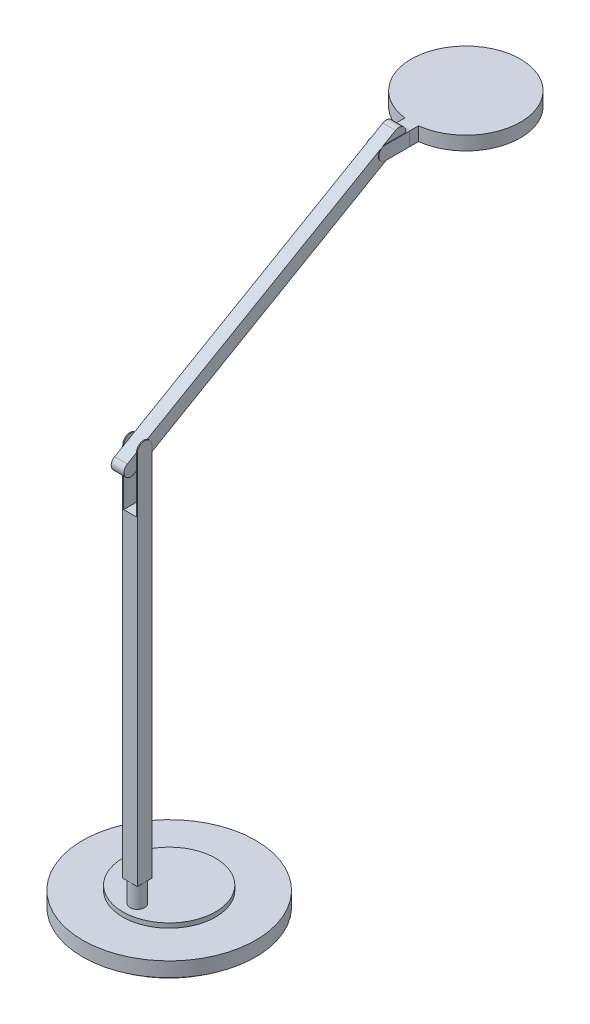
ISO-10303-21;
HEADER;
FILE_DESCRIPTION(('STEP AP214'),'2;1');
FILE_NAME('part.step','',(''),(''),'','','');
FILE_SCHEMA(('AUTOMOTIVE_DESIGN { 1 0 10303 214 1 1 1 1 }'));
ENDSEC;
DATA;
#1=APPLICATION_CONTEXT('core data for automotive mechanical design processes');
#2=APPLICATION_PROTOCOL_DEFINITION('international standard','automotive_design',2000,#1);
#3=PRODUCT_CONTEXT('',#1,'mechanical');
#4=PRODUCT('Part','Part','',(#3));
#5=PRODUCT_RELATED_PRODUCT_CATEGORY('part','',(#4));
#6=PRODUCT_DEFINITION_FORMATION('','',#4);
#7=PRODUCT_DEFINITION_CONTEXT('part definition',#1,'design');
#8=PRODUCT_DEFINITION('design','',#6,#7);
#9=PRODUCT_DEFINITION_SHAPE('','',#8);
#10=(LENGTH_UNIT() NAMED_UNIT(*) SI_UNIT(.MILLI.,.METRE.));
#11=(NAMED_UNIT(*) PLANE_ANGLE_UNIT() SI_UNIT($,.RADIAN.));
#12=(NAMED_UNIT(*) SI_UNIT($,.STERADIAN.) SOLID_ANGLE_UNIT());
#13=UNCERTAINTY_MEASURE_WITH_UNIT(LENGTH_MEASURE(1.E-05),#10,'distance_accuracy_value','');
#14=(GEOMETRIC_REPRESENTATION_CONTEXT(3) GLOBAL_UNCERTAINTY_ASSIGNED_CONTEXT((#13)) GLOBAL_UNIT_ASSIGNED_CONTEXT((#10,
#11,#12)) REPRESENTATION_CONTEXT('',''));
#15=CARTESIAN_POINT('',(0.,0.,0.));
#16=DIRECTION('',(0.,0.,1.));
#17=DIRECTION('',(1.,0.,0.));
#18=AXIS2_PLACEMENT_3D('',#15,#16,#17);
#19=CARTESIAN_POINT('',(-7.5,604.576882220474,-256.636937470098));
#20=DIRECTION('',(0.,-1.,0.));
#21=DIRECTION('',(0.,0.,-1.));
#22=AXIS2_PLACEMENT_3D('',#19,#20,#21);
#23=PLANE('',#22);
#24=CARTESIAN_POINT('',(0.,604.576882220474,-325.745044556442));
#25=DIRECTION('',(0.,-1.,0.));
#26=DIRECTION('',(0.,0.,-1.));
#27=AXIS2_PLACEMENT_3D('',#24,#25,#26);
#28=CIRCLE('',#27,47.9999999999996);
#29=CARTESIAN_POINT('',(0.,604.576882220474,-373.745044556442));
#30=VERTEX_POINT('',#29);
#31=EDGE_CURVE('E150',#30,#30,#28,.T.);
#32=ORIENTED_EDGE('',*,*,#31,.F.);
#33=EDGE_LOOP('',(#32));
#34=FACE_BOUND('',#33,.T.);
#35=DIRECTION('',(0.,0.,1.));
#36=VECTOR('',#35,1.);
#37=CARTESIAN_POINT('',(-7.5,604.576882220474,-266.21564005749));
#38=LINE('',#37,#36);
#39=CARTESIAN_POINT('',(-7.50000000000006,604.576882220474,-266.215640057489));
#40=VERTEX_POINT('',#39);
#41=CARTESIAN_POINT('',(-7.5,604.576882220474,-256.636937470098));
#42=VERTEX_POINT('',#41);
#43=EDGE_CURVE('E81',#40,#42,#38,.T.);
#44=ORIENTED_EDGE('',*,*,#43,.F.);
#45=CARTESIAN_POINT('',(0.,604.576882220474,-325.745044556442));
#46=DIRECTION('',(0.,-1.,0.));
#47=DIRECTION('',(0.,0.,-1.));
#48=AXIS2_PLACEMENT_3D('',#45,#46,#47);
#49=CIRCLE('',#48,60.);
#50=CARTESIAN_POINT('',(7.5,604.576882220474,-266.21564005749));
#51=VERTEX_POINT('',#50);
#52=EDGE_CURVE('E104',#51,#40,#49,.F.);
#53=ORIENTED_EDGE('',*,*,#52,.F.);
#54=DIRECTION('',(0.,0.,-1.));
#55=VECTOR('',#54,1.);
#56=CARTESIAN_POINT('',(7.5,604.576882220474,-256.6369374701));
#57=LINE('',#56,#55);
#58=CARTESIAN_POINT('',(7.5,604.576882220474,-256.636937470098));
#59=VERTEX_POINT('',#58);
#60=EDGE_CURVE('E109',#59,#51,#57,.T.);
#61=ORIENTED_EDGE('',*,*,#60,.F.);
#62=DIRECTION('',(1.,0.,0.));
#63=VECTOR('',#62,1.);
#64=CARTESIAN_POINT('',(-7.5,604.576882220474,-256.636937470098));
#65=LINE('',#64,#63);
#66=EDGE_CURVE('E124',#42,#59,#65,.T.);
#67=ORIENTED_EDGE('',*,*,#66,.F.);
#68=EDGE_LOOP('',(#44,#53,#61,#67));
#69=FACE_BOUND('',#68,.T.);
#70=ADVANCED_FACE('F73',(#34,#69),#23,.T.);
#71=CARTESIAN_POINT('',(0.,619.576882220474,-325.745044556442));
#72=DIRECTION('',(0.,1.,0.));
#73=DIRECTION('',(0.,0.,1.));
#74=AXIS2_PLACEMENT_3D('',#71,#72,#73);
#75=PLANE('',#74);
#76=DIRECTION('',(0.,0.,1.));
#77=VECTOR('',#76,1.);
#78=CARTESIAN_POINT('',(-7.5,619.576882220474,-266.215640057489));
#79=LINE('',#78,#77);
#80=CARTESIAN_POINT('',(-7.50000000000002,619.576882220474,-266.215640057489));
#81=VERTEX_POINT('',#80);
#82=CARTESIAN_POINT('',(-7.5,619.576882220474,-256.636937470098));
#83=VERTEX_POINT('',#82);
#84=EDGE_CURVE('E133',#81,#83,#79,.T.);
#85=ORIENTED_EDGE('',*,*,#84,.T.);
#86=DIRECTION('',(1.,0.,0.));
#87=VECTOR('',#86,1.);
#88=CARTESIAN_POINT('',(-7.5,619.576882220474,-256.636937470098));
#89=LINE('',#88,#87);
#90=CARTESIAN_POINT('',(7.5,619.576882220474,-256.636937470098));
#91=VERTEX_POINT('',#90);
#92=EDGE_CURVE('E122',#83,#91,#89,.T.);
#93=ORIENTED_EDGE('',*,*,#92,.T.);
#94=DIRECTION('',(0.,0.,-1.));
#95=VECTOR('',#94,1.);
#96=CARTESIAN_POINT('',(7.5,619.576882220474,-256.636937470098));
#97=LINE('',#96,#95);
#98=CARTESIAN_POINT('',(7.5,619.576882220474,-266.215640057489));
#99=VERTEX_POINT('',#98);
#100=EDGE_CURVE('E125',#91,#99,#97,.T.);
#101=ORIENTED_EDGE('',*,*,#100,.T.);
#102=CARTESIAN_POINT('',(0.,619.576882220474,-325.745044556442));
#103=DIRECTION('',(0.,1.,0.));
#104=DIRECTION('',(0.,0.,1.));
#105=AXIS2_PLACEMENT_3D('',#102,#103,#104);
#106=CIRCLE('',#105,60.);
#107=EDGE_CURVE('E130',#99,#81,#106,.T.);
#108=ORIENTED_EDGE('',*,*,#107,.T.);
#109=EDGE_LOOP('',(#85,#93,#101,#108));
#110=FACE_BOUND('',#109,.T.);
#111=ADVANCED_FACE('F132',(#110),#75,.T.);
#112=CARTESIAN_POINT('',(-7.5,428.313149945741,-256.636937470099));
#113=DIRECTION('',(0.,0.,1.));
#114=DIRECTION('',(0.,-1.,0.));
#115=AXIS2_PLACEMENT_3D('',#112,#113,#114);
#116=PLANE('',#115);
#117=DIRECTION('',(0.,1.,0.));
#118=VECTOR('',#117,1.);
#119=CARTESIAN_POINT('',(-7.5,428.313149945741,-256.636937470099));
#120=LINE('',#119,#118);
#121=EDGE_CURVE('E13',#42,#83,#120,.T.);
#122=ORIENTED_EDGE('',*,*,#121,.F.);
#123=ORIENTED_EDGE('',*,*,#66,.T.);
#124=DIRECTION('',(0.,1.,0.));
#125=VECTOR('',#124,1.);
#126=CARTESIAN_POINT('',(7.5,428.313149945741,-256.636937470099));
#127=LINE('',#126,#125);
#128=EDGE_CURVE('E119',#59,#91,#127,.T.);
#129=ORIENTED_EDGE('',*,*,#128,.T.);
#130=ORIENTED_EDGE('',*,*,#92,.F.);
#131=EDGE_LOOP('',(#122,#123,#129,#130));
#132=FACE_BOUND('',#131,.T.);
#133=ADVANCED_FACE('F120',(#132),#116,.T.);
#134=CARTESIAN_POINT('',(7.5,428.313149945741,-256.636937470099));
#135=DIRECTION('',(1.,0.,0.));
#136=DIRECTION('',(0.,0.,-1.));
#137=AXIS2_PLACEMENT_3D('',#134,#135,#136);
#138=PLANE('',#137);
#139=ORIENTED_EDGE('',*,*,#128,.F.);
#140=ORIENTED_EDGE('',*,*,#60,.T.);
#141=DIRECTION('',(0.,1.,0.));
#142=VECTOR('',#141,1.);
#143=CARTESIAN_POINT('',(7.5,428.313149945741,-266.21564005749));
#144=LINE('',#143,#142);
#145=EDGE_CURVE('E114',#51,#99,#144,.T.);
#146=ORIENTED_EDGE('',*,*,#145,.T.);
#147=ORIENTED_EDGE('',*,*,#100,.F.);
#148=EDGE_LOOP('',(#139,#140,#146,#147));
#149=FACE_BOUND('',#148,.T.);
#150=ADVANCED_FACE('F126',(#149),#138,.T.);
#151=CARTESIAN_POINT('',(0.,428.313149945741,-325.745044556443));
#152=DIRECTION('',(0.,1.,0.));
#153=DIRECTION('',(0.,0.,1.));
#154=AXIS2_PLACEMENT_3D('',#151,#152,#153);
#155=CYLINDRICAL_SURFACE('',#154,60.);
#156=ORIENTED_EDGE('',*,*,#145,.F.);
#157=ORIENTED_EDGE('',*,*,#52,.T.);
#158=DIRECTION('',(0.,1.,0.));
#159=VECTOR('',#158,1.);
#160=CARTESIAN_POINT('',(-7.50000000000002,428.313149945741,-266.21564005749));
#161=LINE('',#160,#159);
#162=EDGE_CURVE('E141',#40,#81,#161,.T.);
#163=ORIENTED_EDGE('',*,*,#162,.T.);
#164=ORIENTED_EDGE('',*,*,#107,.F.);
#165=EDGE_LOOP('',(#156,#157,#163,#164));
#166=FACE_BOUND('',#165,.T.);
#167=ADVANCED_FACE('F147',(#166),#155,.T.);
#168=CARTESIAN_POINT('',(-7.5,428.313149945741,-266.21564005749));
#169=DIRECTION('',(-1.,0.,0.));
#170=DIRECTION('',(0.,0.,1.));
#171=AXIS2_PLACEMENT_3D('',#168,#169,#170);
#172=PLANE('',#171);
#173=ORIENTED_EDGE('',*,*,#162,.F.);
#174=ORIENTED_EDGE('',*,*,#43,.T.);
#175=ORIENTED_EDGE('',*,*,#121,.T.);
#176=ORIENTED_EDGE('',*,*,#84,.F.);
#177=EDGE_LOOP('',(#173,#174,#175,#176));
#178=FACE_BOUND('',#177,.T.);
#179=ADVANCED_FACE('F148',(#178),#172,.T.);
#180=CARTESIAN_POINT('',(0.,606.576882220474,-325.745044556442));
#181=DIRECTION('',(0.,-1.,0.));
#182=DIRECTION('',(0.,0.,-1.));
#183=AXIS2_PLACEMENT_3D('',#180,#181,#182);
#184=CYLINDRICAL_SURFACE('',#183,47.9999999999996);
#185=CARTESIAN_POINT('',(0.,606.576882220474,-325.745044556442));
#186=DIRECTION('',(0.,-1.,0.));
#187=DIRECTION('',(0.,0.,-1.));
#188=AXIS2_PLACEMENT_3D('',#185,#186,#187);
#189=CIRCLE('',#188,47.9999999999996);
#190=CARTESIAN_POINT('',(0.,606.576882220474,-373.745044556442));
#191=VERTEX_POINT('',#190);
#192=EDGE_CURVE('E135',#191,#191,#189,.T.);
#193=ORIENTED_EDGE('',*,*,#192,.F.);
#194=EDGE_LOOP('',(#193));
#195=FACE_BOUND('',#194,.T.);
#196=ORIENTED_EDGE('',*,*,#31,.T.);
#197=EDGE_LOOP('',(#196));
#198=FACE_BOUND('',#197,.T.);
#199=ADVANCED_FACE('F158',(#195,#198),#184,.F.);
#200=CARTESIAN_POINT('',(0.,606.576882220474,-325.745044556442));
#201=DIRECTION('',(0.,-1.,0.));
#202=DIRECTION('',(0.,0.,-1.));
#203=AXIS2_PLACEMENT_3D('',#200,#201,#202);
#204=PLANE('',#203);
#205=ORIENTED_EDGE('',*,*,#192,.T.);
#206=EDGE_LOOP('',(#205));
#207=FACE_BOUND('',#206,.T.);
#208=ADVANCED_FACE('F156',(#207),#204,.T.);
#209=CLOSED_SHELL('',(#70,#111,#133,#150,#167,#179,#199,#208));
#210=MANIFOLD_SOLID_BREP('B2',#209);
#211=CARTESIAN_POINT('',(7.,402.,43.));
#212=DIRECTION('',(1.,0.,0.));
#213=DIRECTION('',(0.,0.,-1.));
#214=AXIS2_PLACEMENT_3D('',#211,#212,#213);
#215=PLANE('',#214);
#216=DIRECTION('',(0.,0.,-1.));
#217=VECTOR('',#216,1.);
#218=CARTESIAN_POINT('',(7.,604.576882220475,42.9999999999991));
#219=LINE('',#218,#217);
#220=CARTESIAN_POINT('',(7.,604.576882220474,-230.136937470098));
#221=VERTEX_POINT('',#220);
#222=CARTESIAN_POINT('',(7.00000000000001,604.576882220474,-232.146556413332));
#223=VERTEX_POINT('',#222);
#224=EDGE_CURVE('E481',#221,#223,#219,.T.);
#225=ORIENTED_EDGE('',*,*,#224,.F.);
#226=CARTESIAN_POINT('',(7.,612.076882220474,-230.136937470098));
#227=DIRECTION('',(1.,0.,0.));
#228=DIRECTION('',(0.,0.,-1.));
#229=AXIS2_PLACEMENT_3D('',#226,#227,#228);
#230=CIRCLE('',#229,7.49999999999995);
#231=CARTESIAN_POINT('',(7.00000000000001,618.572072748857,-226.386937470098));
#232=VERTEX_POINT('',#231);
#233=EDGE_CURVE('E472',#232,#221,#230,.T.);
#234=ORIENTED_EDGE('',*,*,#233,.F.);
#235=DIRECTION('',(0.,0.5,-0.866025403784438));
#236=VECTOR('',#235,1.);
#237=CARTESIAN_POINT('',(7.00000000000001,365.900635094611,211.252830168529));
#238=LINE('',#237,#236);
#239=CARTESIAN_POINT('',(7.00000000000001,469.94886698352,31.0360060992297));
#240=VERTEX_POINT('',#239);
#241=EDGE_CURVE('E753',#240,#232,#238,.T.);
#242=ORIENTED_EDGE('',*,*,#241,.F.);
#243=CARTESIAN_POINT('',(7.00000000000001,463.,35.));
#244=DIRECTION('',(1.,0.,0.));
#245=DIRECTION('',(0.,0.,-1.));
#246=AXIS2_PLACEMENT_3D('',#243,#244,#245);
#247=CIRCLE('',#246,8.);
#248=CARTESIAN_POINT('',(7.00000000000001,463.,27.));
#249=VERTEX_POINT('',#248);
#250=EDGE_CURVE('E727',#249,#240,#247,.T.);
#251=ORIENTED_EDGE('',*,*,#250,.F.);
#252=DIRECTION('',(0.,1.,0.));
#253=VECTOR('',#252,1.);
#254=CARTESIAN_POINT('',(7.,471.,27.));
#255=LINE('',#254,#253);
#256=CARTESIAN_POINT('',(7.,454.958548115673,27.));
#257=VERTEX_POINT('',#256);
#258=EDGE_CURVE('E544',#257,#249,#255,.T.);
#259=ORIENTED_EDGE('',*,*,#258,.F.);
#260=DIRECTION('',(0.,0.5,-0.866025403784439));
#261=VECTOR('',#260,1.);
#262=CARTESIAN_POINT('',(7.00000000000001,352.910254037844,203.752830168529));
#263=LINE('',#262,#261);
#264=EDGE_CURVE('E520',#257,#223,#263,.T.);
#265=ORIENTED_EDGE('',*,*,#264,.T.);
#266=EDGE_LOOP('',(#225,#234,#242,#251,#259,#265));
#267=FACE_BOUND('',#266,.T.);
#268=ADVANCED_FACE('F230',(#267),#215,.T.);
#269=CARTESIAN_POINT('',(-7.,402.,27.));
#270=DIRECTION('',(-1.,0.,0.));
#271=DIRECTION('',(0.,0.,1.));
#272=AXIS2_PLACEMENT_3D('',#269,#270,#271);
#273=PLANE('',#272);
#274=DIRECTION('',(0.,0.,1.));
#275=VECTOR('',#274,1.);
#276=CARTESIAN_POINT('',(-7.,604.576882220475,26.9999999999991));
#277=LINE('',#276,#275);
#278=CARTESIAN_POINT('',(-7.00000000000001,604.576882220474,-232.146556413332));
#279=VERTEX_POINT('',#278);
#280=CARTESIAN_POINT('',(-7.,604.576882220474,-230.136937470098));
#281=VERTEX_POINT('',#280);
#282=EDGE_CURVE('E478',#279,#281,#277,.T.);
#283=ORIENTED_EDGE('',*,*,#282,.F.);
#284=DIRECTION('',(0.,0.5,-0.866025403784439));
#285=VECTOR('',#284,1.);
#286=CARTESIAN_POINT('',(-7.00000000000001,352.910254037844,203.752830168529));
#287=LINE('',#286,#285);
#288=CARTESIAN_POINT('',(-7.,454.958548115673,27.));
#289=VERTEX_POINT('',#288);
#290=EDGE_CURVE('E496',#289,#279,#287,.T.);
#291=ORIENTED_EDGE('',*,*,#290,.F.);
#292=DIRECTION('',(0.,-1.,0.));
#293=VECTOR('',#292,1.);
#294=CARTESIAN_POINT('',(-7.,471.,27.));
#295=LINE('',#294,#293);
#296=CARTESIAN_POINT('',(-7.00000000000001,463.,27.));
#297=VERTEX_POINT('',#296);
#298=EDGE_CURVE('E514',#297,#289,#295,.T.);
#299=ORIENTED_EDGE('',*,*,#298,.F.);
#300=CARTESIAN_POINT('',(-7.00000000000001,463.,35.));
#301=DIRECTION('',(-1.,0.,0.));
#302=DIRECTION('',(0.,0.,1.));
#303=AXIS2_PLACEMENT_3D('',#300,#301,#302);
#304=CIRCLE('',#303,8.);
#305=CARTESIAN_POINT('',(-7.00000000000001,469.94886698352,31.0360060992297));
#306=VERTEX_POINT('',#305);
#307=EDGE_CURVE('E567',#306,#297,#304,.T.);
#308=ORIENTED_EDGE('',*,*,#307,.F.);
#309=DIRECTION('',(0.,0.5,-0.866025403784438));
#310=VECTOR('',#309,1.);
#311=CARTESIAN_POINT('',(-7.00000000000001,365.900635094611,211.252830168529));
#312=LINE('',#311,#310);
#313=CARTESIAN_POINT('',(-7.00000000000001,618.572072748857,-226.386937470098));
#314=VERTEX_POINT('',#313);
#315=EDGE_CURVE('E747',#306,#314,#312,.T.);
#316=ORIENTED_EDGE('',*,*,#315,.T.);
#317=CARTESIAN_POINT('',(-7.,612.076882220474,-230.136937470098));
#318=DIRECTION('',(-1.,0.,0.));
#319=DIRECTION('',(0.,0.,1.));
#320=AXIS2_PLACEMENT_3D('',#317,#318,#319);
#321=CIRCLE('',#320,7.49999999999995);
#322=EDGE_CURVE('E458',#281,#314,#321,.T.);
#323=ORIENTED_EDGE('',*,*,#322,.F.);
#324=EDGE_LOOP('',(#283,#291,#299,#308,#316,#323));
#325=FACE_BOUND('',#324,.T.);
#326=ADVANCED_FACE('F826',(#325),#273,.T.);
#327=CARTESIAN_POINT('',(-7.,402.,27.));
#328=DIRECTION('',(-1.,0.,0.));
#329=DIRECTION('',(0.,0.,1.));
#330=AXIS2_PLACEMENT_3D('',#327,#328,#329);
#331=PLANE('',#330);
#332=CARTESIAN_POINT('',(-7.,445.720943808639,43.));
#333=VERTEX_POINT('',#332);
#334=EDGE_CURVE('E495',#333,#289,#287,.T.);
#335=ORIENTED_EDGE('',*,*,#334,.F.);
#336=DIRECTION('',(0.,1.,0.));
#337=VECTOR('',#336,1.);
#338=CARTESIAN_POINT('',(-7.,402.,43.));
#339=LINE('',#338,#337);
#340=CARTESIAN_POINT('',(-7.,402.,43.));
#341=VERTEX_POINT('',#340);
#342=EDGE_CURVE('E586',#341,#333,#339,.T.);
#343=ORIENTED_EDGE('',*,*,#342,.F.);
#344=DIRECTION('',(0.,0.,1.));
#345=VECTOR('',#344,1.);
#346=CARTESIAN_POINT('',(-7.,402.,27.));
#347=LINE('',#346,#345);
#348=CARTESIAN_POINT('',(-7.,402.,27.));
#349=VERTEX_POINT('',#348);
#350=EDGE_CURVE('E581',#349,#341,#347,.T.);
#351=ORIENTED_EDGE('',*,*,#350,.F.);
#352=DIRECTION('',(0.,1.,0.));
#353=VECTOR('',#352,1.);
#354=CARTESIAN_POINT('',(-7.,402.,27.));
#355=LINE('',#354,#353);
#356=EDGE_CURVE('E591',#349,#289,#355,.T.);
#357=ORIENTED_EDGE('',*,*,#356,.T.);
#358=EDGE_LOOP('',(#335,#343,#351,#357));
#359=FACE_BOUND('',#358,.T.);
#360=ADVANCED_FACE('F851',(#359),#331,.F.);
#361=CARTESIAN_POINT('',(7.,402.,43.));
#362=DIRECTION('',(1.,0.,0.));
#363=DIRECTION('',(0.,0.,-1.));
#364=AXIS2_PLACEMENT_3D('',#361,#362,#363);
#365=PLANE('',#364);
#366=CARTESIAN_POINT('',(7.,445.720943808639,43.));
#367=VERTEX_POINT('',#366);
#368=EDGE_CURVE('E519',#367,#257,#263,.T.);
#369=ORIENTED_EDGE('',*,*,#368,.T.);
#370=DIRECTION('',(0.,1.,0.));
#371=VECTOR('',#370,1.);
#372=CARTESIAN_POINT('',(7.,402.,27.));
#373=LINE('',#372,#371);
#374=CARTESIAN_POINT('',(7.,402.,27.));
#375=VERTEX_POINT('',#374);
#376=EDGE_CURVE('E595',#375,#257,#373,.T.);
#377=ORIENTED_EDGE('',*,*,#376,.F.);
#378=DIRECTION('',(0.,0.,-1.));
#379=VECTOR('',#378,1.);
#380=CARTESIAN_POINT('',(7.,402.,43.));
#381=LINE('',#380,#379);
#382=CARTESIAN_POINT('',(7.,402.,43.));
#383=VERTEX_POINT('',#382);
#384=EDGE_CURVE('E574',#383,#375,#381,.T.);
#385=ORIENTED_EDGE('',*,*,#384,.F.);
#386=DIRECTION('',(0.,1.,0.));
#387=VECTOR('',#386,1.);
#388=CARTESIAN_POINT('',(7.,402.,43.));
#389=LINE('',#388,#387);
#390=EDGE_CURVE('E585',#383,#367,#389,.T.);
#391=ORIENTED_EDGE('',*,*,#390,.T.);
#392=EDGE_LOOP('',(#369,#377,#385,#391));
#393=FACE_BOUND('',#392,.T.);
#394=ADVANCED_FACE('F782',(#393),#365,.F.);
#395=CARTESIAN_POINT('',(-8.,471.,43.));
#396=DIRECTION('',(1.,0.,0.));
#397=DIRECTION('',(0.,0.,-1.));
#398=AXIS2_PLACEMENT_3D('',#395,#396,#397);
#399=PLANE('',#398);
#400=DIRECTION('',(0.,-1.,0.));
#401=VECTOR('',#400,1.);
#402=CARTESIAN_POINT('',(-8.,471.,43.));
#403=LINE('',#402,#401);
#404=CARTESIAN_POINT('',(-8.,463.,43.));
#405=VERTEX_POINT('',#404);
#406=CARTESIAN_POINT('',(-8.,51.,43.));
#407=VERTEX_POINT('',#406);
#408=EDGE_CURVE('E627',#405,#407,#403,.T.);
#409=ORIENTED_EDGE('',*,*,#408,.F.);
#410=CARTESIAN_POINT('',(-8.,463.,35.));
#411=DIRECTION('',(-1.,0.,0.));
#412=DIRECTION('',(0.,0.,1.));
#413=AXIS2_PLACEMENT_3D('',#410,#411,#412);
#414=CIRCLE('',#413,8.);
#415=CARTESIAN_POINT('',(-8.,463.,27.));
#416=VERTEX_POINT('',#415);
#417=EDGE_CURVE('E553',#405,#416,#414,.T.);
#418=ORIENTED_EDGE('',*,*,#417,.T.);
#419=DIRECTION('',(0.,-1.,0.));
#420=VECTOR('',#419,1.);
#421=CARTESIAN_POINT('',(-8.,471.,27.));
#422=LINE('',#421,#420);
#423=CARTESIAN_POINT('',(-8.,51.,27.));
#424=VERTEX_POINT('',#423);
#425=EDGE_CURVE('E630',#416,#424,#422,.T.);
#426=ORIENTED_EDGE('',*,*,#425,.T.);
#427=DIRECTION('',(0.,0.,1.));
#428=VECTOR('',#427,1.);
#429=CARTESIAN_POINT('',(-8.,51.,43.));
#430=LINE('',#429,#428);
#431=CARTESIAN_POINT('',(-8.,51.,35.));
#432=VERTEX_POINT('',#431);
#433=EDGE_CURVE('E602',#424,#432,#430,.T.);
#434=ORIENTED_EDGE('',*,*,#433,.T.);
#435=EDGE_CURVE('E590',#432,#407,#430,.T.);
#436=ORIENTED_EDGE('',*,*,#435,.T.);
#437=EDGE_LOOP('',(#409,#418,#426,#434,#436));
#438=FACE_BOUND('',#437,.T.);
#439=ADVANCED_FACE('F858',(#438),#399,.F.);
#440=CARTESIAN_POINT('',(8.,471.,27.));
#441=DIRECTION('',(-1.,0.,0.));
#442=DIRECTION('',(0.,0.,1.));
#443=AXIS2_PLACEMENT_3D('',#440,#441,#442);
#444=PLANE('',#443);
#445=CARTESIAN_POINT('',(8.00000000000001,463.,35.));
#446=DIRECTION('',(-1.,0.,0.));
#447=DIRECTION('',(0.,0.,1.));
#448=AXIS2_PLACEMENT_3D('',#445,#446,#447);
#449=CIRCLE('',#448,8.);
#450=CARTESIAN_POINT('',(8.00000000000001,463.,43.));
#451=VERTEX_POINT('',#450);
#452=CARTESIAN_POINT('',(8.00000000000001,463.,27.));
#453=VERTEX_POINT('',#452);
#454=EDGE_CURVE('E565',#451,#453,#449,.T.);
#455=ORIENTED_EDGE('',*,*,#454,.F.);
#456=DIRECTION('',(0.,-1.,0.));
#457=VECTOR('',#456,1.);
#458=CARTESIAN_POINT('',(8.,471.,43.));
#459=LINE('',#458,#457);
#460=CARTESIAN_POINT('',(8.,51.,43.));
#461=VERTEX_POINT('',#460);
#462=EDGE_CURVE('E624',#451,#461,#459,.T.);
#463=ORIENTED_EDGE('',*,*,#462,.T.);
#464=DIRECTION('',(0.,0.,-1.));
#465=VECTOR('',#464,1.);
#466=CARTESIAN_POINT('',(8.,51.,27.));
#467=LINE('',#466,#465);
#468=CARTESIAN_POINT('',(8.,51.,35.));
#469=VERTEX_POINT('',#468);
#470=EDGE_CURVE('E612',#461,#469,#467,.T.);
#471=ORIENTED_EDGE('',*,*,#470,.T.);
#472=CARTESIAN_POINT('',(8.,51.,27.));
#473=VERTEX_POINT('',#472);
#474=EDGE_CURVE('E611',#469,#473,#467,.T.);
#475=ORIENTED_EDGE('',*,*,#474,.T.);
#476=DIRECTION('',(0.,-1.,0.));
#477=VECTOR('',#476,1.);
#478=CARTESIAN_POINT('',(8.,471.,27.));
#479=LINE('',#478,#477);
#480=EDGE_CURVE('E621',#453,#473,#479,.T.);
#481=ORIENTED_EDGE('',*,*,#480,.F.);
#482=EDGE_LOOP('',(#455,#463,#471,#475,#481));
#483=FACE_BOUND('',#482,.T.);
#484=ADVANCED_FACE('F874',(#483),#444,.F.);
#485=CARTESIAN_POINT('',(-7.00000000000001,463.041514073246,42.9998922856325));
#486=VERTEX_POINT('',#485);
#487=EDGE_CURVE('E566',#486,#306,#304,.T.);
#488=ORIENTED_EDGE('',*,*,#487,.F.);
#489=EDGE_CURVE('E503',#486,#306,#312,.T.);
#490=ORIENTED_EDGE('',*,*,#489,.T.);
#491=EDGE_LOOP('',(#488,#490));
#492=FACE_BOUND('',#491,.T.);
#493=ADVANCED_FACE('F922',(#492),#331,.F.);
#494=CARTESIAN_POINT('',(7.00000000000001,463.041514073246,42.9998922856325));
#495=VERTEX_POINT('',#494);
#496=EDGE_CURVE('E730',#240,#495,#247,.T.);
#497=ORIENTED_EDGE('',*,*,#496,.F.);
#498=EDGE_CURVE('E509',#495,#240,#238,.T.);
#499=ORIENTED_EDGE('',*,*,#498,.F.);
#500=EDGE_LOOP('',(#497,#499));
#501=FACE_BOUND('',#500,.T.);
#502=ADVANCED_FACE('F764',(#501),#365,.F.);
#503=CARTESIAN_POINT('',(0.,471.,27.));
#504=DIRECTION('',(0.,0.,1.));
#505=DIRECTION('',(1.,0.,0.));
#506=AXIS2_PLACEMENT_3D('',#503,#504,#505);
#507=PLANE('',#506);
#508=DIRECTION('',(-1.,0.,0.));
#509=VECTOR('',#508,1.);
#510=CARTESIAN_POINT('',(96.8254983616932,463.,27.));
#511=LINE('',#510,#509);
#512=EDGE_CURVE('E560',#453,#249,#511,.T.);
#513=ORIENTED_EDGE('',*,*,#512,.F.);
#514=ORIENTED_EDGE('',*,*,#480,.T.);
#515=DIRECTION('',(-1.,0.,0.));
#516=VECTOR('',#515,1.);
#517=CARTESIAN_POINT('',(0.,51.,27.));
#518=LINE('',#517,#516);
#519=CARTESIAN_POINT('',(0.,51.,27.));
#520=VERTEX_POINT('',#519);
#521=EDGE_CURVE('E617',#473,#520,#518,.T.);
#522=ORIENTED_EDGE('',*,*,#521,.T.);
#523=EDGE_CURVE('E616',#520,#424,#518,.T.);
#524=ORIENTED_EDGE('',*,*,#523,.T.);
#525=ORIENTED_EDGE('',*,*,#425,.F.);
#526=EDGE_CURVE('E557',#297,#416,#511,.T.);
#527=ORIENTED_EDGE('',*,*,#526,.F.);
#528=ORIENTED_EDGE('',*,*,#298,.T.);
#529=ORIENTED_EDGE('',*,*,#356,.F.);
#530=DIRECTION('',(-1.,0.,0.));
#531=VECTOR('',#530,1.);
#532=CARTESIAN_POINT('',(7.,402.,27.));
#533=LINE('',#532,#531);
#534=EDGE_CURVE('E578',#375,#349,#533,.T.);
#535=ORIENTED_EDGE('',*,*,#534,.F.);
#536=ORIENTED_EDGE('',*,*,#376,.T.);
#537=ORIENTED_EDGE('',*,*,#258,.T.);
#538=EDGE_LOOP('',(#513,#514,#522,#524,#525,#527,#528,#529,#535,#536,#537));
#539=FACE_BOUND('',#538,.T.);
#540=ADVANCED_FACE('F700',(#539),#507,.F.);
#541=CARTESIAN_POINT('',(0.,0.,0.));
#542=DIRECTION('',(0.,1.,0.));
#543=DIRECTION('',(0.,0.,1.));
#544=AXIS2_PLACEMENT_3D('',#541,#542,#543);
#545=PLANE('',#544);
#546=CARTESIAN_POINT('',(0.,0.,0.));
#547=DIRECTION('',(0.,1.,0.));
#548=DIRECTION('',(0.,0.,1.));
#549=AXIS2_PLACEMENT_3D('',#546,#547,#548);
#550=CIRCLE('',#549,87.);
#551=CARTESIAN_POINT('',(0.,0.,87.));
#552=VERTEX_POINT('',#551);
#553=EDGE_CURVE('E660',#552,#552,#550,.T.);
#554=ORIENTED_EDGE('',*,*,#553,.F.);
#555=EDGE_LOOP('',(#554));
#556=FACE_BOUND('',#555,.T.);
#557=ADVANCED_FACE('F691',(#556),#545,.F.);
#558=CARTESIAN_POINT('',(0.,0.,0.));
#559=DIRECTION('',(0.,1.,0.));
#560=DIRECTION('',(0.,0.,1.));
#561=AXIS2_PLACEMENT_3D('',#558,#559,#560);
#562=CONICAL_SURFACE('',#561,87.,0.927295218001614);
#563=ORIENTED_EDGE('',*,*,#553,.T.);
#564=EDGE_LOOP('',(#563));
#565=FACE_BOUND('',#564,.T.);
#566=CARTESIAN_POINT('',(0.,6.,0.));
#567=DIRECTION('',(0.,1.,0.));
#568=DIRECTION('',(0.,0.,1.));
#569=AXIS2_PLACEMENT_3D('',#566,#567,#568);
#570=CIRCLE('',#569,95.);
#571=CARTESIAN_POINT('',(0.,6.,95.));
#572=VERTEX_POINT('',#571);
#573=EDGE_CURVE('E656',#572,#572,#570,.T.);
#574=ORIENTED_EDGE('',*,*,#573,.F.);
#575=EDGE_LOOP('',(#574));
#576=FACE_BOUND('',#575,.T.);
#577=ADVANCED_FACE('F232',(#565,#576),#562,.T.);
#578=CARTESIAN_POINT('',(0.,22.,0.));
#579=DIRECTION('',(0.,-1.,0.));
#580=DIRECTION('',(0.,0.,-1.));
#581=AXIS2_PLACEMENT_3D('',#578,#579,#580);
#582=CYLINDRICAL_SURFACE('',#581,95.);
#583=CARTESIAN_POINT('',(0.,22.,0.));
#584=DIRECTION('',(0.,1.,0.));
#585=DIRECTION('',(0.,0.,1.));
#586=AXIS2_PLACEMENT_3D('',#583,#584,#585);
#587=CIRCLE('',#586,95.);
#588=CARTESIAN_POINT('',(0.,22.,95.));
#589=VERTEX_POINT('',#588);
#590=EDGE_CURVE('E650',#589,#589,#587,.T.);
#591=ORIENTED_EDGE('',*,*,#590,.F.);
#592=EDGE_LOOP('',(#591));
#593=FACE_BOUND('',#592,.T.);
#594=ORIENTED_EDGE('',*,*,#573,.T.);
#595=EDGE_LOOP('',(#594));
#596=FACE_BOUND('',#595,.T.);
#597=ADVANCED_FACE('F701',(#593,#596),#582,.T.);
#598=CARTESIAN_POINT('',(0.,22.,0.));
#599=DIRECTION('',(0.,1.,0.));
#600=DIRECTION('',(0.,0.,1.));
#601=AXIS2_PLACEMENT_3D('',#598,#599,#600);
#602=PLANE('',#601);
#603=CARTESIAN_POINT('',(0.,22.,0.));
#604=DIRECTION('',(0.,1.,0.));
#605=DIRECTION('',(0.,0.,1.));
#606=AXIS2_PLACEMENT_3D('',#603,#604,#605);
#607=CIRCLE('',#606,51.);
#608=CARTESIAN_POINT('',(0.,22.,51.));
#609=VERTEX_POINT('',#608);
#610=EDGE_CURVE('E651',#609,#609,#607,.T.);
#611=ORIENTED_EDGE('',*,*,#610,.F.);
#612=EDGE_LOOP('',(#611));
#613=FACE_BOUND('',#612,.T.);
#614=ORIENTED_EDGE('',*,*,#590,.T.);
#615=EDGE_LOOP('',(#614));
#616=FACE_BOUND('',#615,.T.);
#617=ADVANCED_FACE('F705',(#613,#616),#602,.T.);
#618=CARTESIAN_POINT('',(0.,27.,0.));
#619=DIRECTION('',(0.,-1.,0.));
#620=DIRECTION('',(0.,0.,-1.));
#621=AXIS2_PLACEMENT_3D('',#618,#619,#620);
#622=CYLINDRICAL_SURFACE('',#621,51.);
#623=CARTESIAN_POINT('',(0.,27.,0.));
#624=DIRECTION('',(0.,1.,0.));
#625=DIRECTION('',(0.,0.,1.));
#626=AXIS2_PLACEMENT_3D('',#623,#624,#625);
#627=CIRCLE('',#626,51.);
#628=CARTESIAN_POINT('',(0.,27.,51.));
#629=VERTEX_POINT('',#628);
#630=EDGE_CURVE('E642',#629,#629,#627,.T.);
#631=ORIENTED_EDGE('',*,*,#630,.F.);
#632=EDGE_LOOP('',(#631));
#633=FACE_BOUND('',#632,.T.);
#634=ORIENTED_EDGE('',*,*,#610,.T.);
#635=EDGE_LOOP('',(#634));
#636=FACE_BOUND('',#635,.T.);
#637=ADVANCED_FACE('F886',(#633,#636),#622,.T.);
#638=CARTESIAN_POINT('',(0.,27.,0.));
#639=DIRECTION('',(0.,1.,0.));
#640=DIRECTION('',(0.,0.,1.));
#641=AXIS2_PLACEMENT_3D('',#638,#639,#640);
#642=PLANE('',#641);
#643=CARTESIAN_POINT('',(0.,27.,35.));
#644=DIRECTION('',(0.,1.,0.));
#645=DIRECTION('',(0.,0.,1.));
#646=AXIS2_PLACEMENT_3D('',#643,#644,#645);
#647=CIRCLE('',#646,8.);
#648=CARTESIAN_POINT('',(0.,27.,43.));
#649=VERTEX_POINT('',#648);
#650=EDGE_CURVE('E637',#649,#649,#647,.T.);
#651=ORIENTED_EDGE('',*,*,#650,.F.);
#652=EDGE_LOOP('',(#651));
#653=FACE_BOUND('',#652,.T.);
#654=ORIENTED_EDGE('',*,*,#630,.T.);
#655=EDGE_LOOP('',(#654));
#656=FACE_BOUND('',#655,.T.);
#657=ADVANCED_FACE('F880',(#653,#656),#642,.T.);
#658=CARTESIAN_POINT('',(0.,51.,35.));
#659=DIRECTION('',(0.,-1.,0.));
#660=DIRECTION('',(0.,0.,-1.));
#661=AXIS2_PLACEMENT_3D('',#658,#659,#660);
#662=CYLINDRICAL_SURFACE('',#661,8.);
#663=CARTESIAN_POINT('',(0.,51.,35.));
#664=DIRECTION('',(0.,1.,0.));
#665=DIRECTION('',(0.,0.,1.));
#666=AXIS2_PLACEMENT_3D('',#663,#664,#665);
#667=CIRCLE('',#666,8.);
#668=CARTESIAN_POINT('',(0.,51.,43.));
#669=VERTEX_POINT('',#668);
#670=EDGE_CURVE('E638',#669,#469,#667,.T.);
#671=ORIENTED_EDGE('',*,*,#670,.F.);
#672=EDGE_CURVE('E256',#432,#669,#667,.T.);
#673=ORIENTED_EDGE('',*,*,#672,.F.);
#674=EDGE_CURVE('E801',#520,#432,#667,.T.);
#675=ORIENTED_EDGE('',*,*,#674,.F.);
#676=EDGE_CURVE('E643',#469,#520,#667,.T.);
#677=ORIENTED_EDGE('',*,*,#676,.F.);
#678=EDGE_LOOP('',(#671,#673,#675,#677));
#679=FACE_BOUND('',#678,.T.);
#680=ORIENTED_EDGE('',*,*,#650,.T.);
#681=EDGE_LOOP('',(#680));
#682=FACE_BOUND('',#681,.T.);
#683=ADVANCED_FACE('F877',(#679,#682),#662,.T.);
#684=CARTESIAN_POINT('',(0.,51.,0.));
#685=DIRECTION('',(0.,-1.,0.));
#686=DIRECTION('',(0.,0.,-1.));
#687=AXIS2_PLACEMENT_3D('',#684,#685,#686);
#688=PLANE('',#687);
#689=DIRECTION('',(1.,0.,0.));
#690=VECTOR('',#689,1.);
#691=CARTESIAN_POINT('',(8.,51.,43.));
#692=LINE('',#691,#690);
#693=EDGE_CURVE('E606',#669,#461,#692,.T.);
#694=ORIENTED_EDGE('',*,*,#693,.F.);
#695=ORIENTED_EDGE('',*,*,#670,.T.);
#696=ORIENTED_EDGE('',*,*,#470,.F.);
#697=EDGE_LOOP('',(#694,#695,#696));
#698=FACE_BOUND('',#697,.T.);
#699=ADVANCED_FACE('F871',(#698),#688,.T.);
#700=ORIENTED_EDGE('',*,*,#474,.F.);
#701=ORIENTED_EDGE('',*,*,#676,.T.);
#702=ORIENTED_EDGE('',*,*,#521,.F.);
#703=EDGE_LOOP('',(#700,#701,#702));
#704=FACE_BOUND('',#703,.T.);
#705=ADVANCED_FACE('F876',(#704),#688,.T.);
#706=ORIENTED_EDGE('',*,*,#523,.F.);
#707=ORIENTED_EDGE('',*,*,#674,.T.);
#708=ORIENTED_EDGE('',*,*,#433,.F.);
#709=EDGE_LOOP('',(#706,#707,#708));
#710=FACE_BOUND('',#709,.T.);
#711=ADVANCED_FACE('F863',(#710),#688,.T.);
#712=CARTESIAN_POINT('',(8.,471.,43.));
#713=DIRECTION('',(0.,0.,-1.));
#714=DIRECTION('',(-1.,0.,0.));
#715=AXIS2_PLACEMENT_3D('',#712,#713,#714);
#716=PLANE('',#715);
#717=ORIENTED_EDGE('',*,*,#462,.F.);
#718=DIRECTION('',(-1.,0.,0.));
#719=VECTOR('',#718,1.);
#720=CARTESIAN_POINT('',(96.8254983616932,463.,43.));
#721=LINE('',#720,#719);
#722=CARTESIAN_POINT('',(7.00000000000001,463.,43.));
#723=VERTEX_POINT('',#722);
#724=EDGE_CURVE('E552',#451,#723,#721,.T.);
#725=ORIENTED_EDGE('',*,*,#724,.T.);
#726=DIRECTION('',(0.,-1.,0.));
#727=VECTOR('',#726,1.);
#728=CARTESIAN_POINT('',(7.,471.,43.));
#729=LINE('',#728,#727);
#730=EDGE_CURVE('E540',#723,#367,#729,.T.);
#731=ORIENTED_EDGE('',*,*,#730,.T.);
#732=ORIENTED_EDGE('',*,*,#390,.F.);
#733=DIRECTION('',(1.,0.,0.));
#734=VECTOR('',#733,1.);
#735=CARTESIAN_POINT('',(-7.,402.,43.));
#736=LINE('',#735,#734);
#737=EDGE_CURVE('E570',#341,#383,#736,.T.);
#738=ORIENTED_EDGE('',*,*,#737,.F.);
#739=ORIENTED_EDGE('',*,*,#342,.T.);
#740=DIRECTION('',(0.,1.,0.));
#741=VECTOR('',#740,1.);
#742=CARTESIAN_POINT('',(-7.,471.,43.));
#743=LINE('',#742,#741);
#744=CARTESIAN_POINT('',(-7.00000000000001,463.,43.));
#745=VERTEX_POINT('',#744);
#746=EDGE_CURVE('E536',#333,#745,#743,.T.);
#747=ORIENTED_EDGE('',*,*,#746,.T.);
#748=EDGE_CURVE('E548',#745,#405,#721,.T.);
#749=ORIENTED_EDGE('',*,*,#748,.T.);
#750=ORIENTED_EDGE('',*,*,#408,.T.);
#751=EDGE_CURVE('E607',#407,#669,#692,.T.);
#752=ORIENTED_EDGE('',*,*,#751,.T.);
#753=ORIENTED_EDGE('',*,*,#693,.T.);
#754=EDGE_LOOP('',(#717,#725,#731,#732,#738,#739,#747,#749,#750,#752,#753));
#755=FACE_BOUND('',#754,.T.);
#756=ADVANCED_FACE('F790',(#755),#716,.F.);
#757=ORIENTED_EDGE('',*,*,#435,.F.);
#758=ORIENTED_EDGE('',*,*,#672,.T.);
#759=ORIENTED_EDGE('',*,*,#751,.F.);
#760=EDGE_LOOP('',(#757,#758,#759));
#761=FACE_BOUND('',#760,.T.);
#762=ADVANCED_FACE('F867',(#761),#688,.T.);
#763=CARTESIAN_POINT('',(0.,402.,0.));
#764=DIRECTION('',(0.,1.,0.));
#765=DIRECTION('',(0.,0.,1.));
#766=AXIS2_PLACEMENT_3D('',#763,#764,#765);
#767=PLANE('',#766);
#768=ORIENTED_EDGE('',*,*,#737,.T.);
#769=ORIENTED_EDGE('',*,*,#384,.T.);
#770=ORIENTED_EDGE('',*,*,#534,.T.);
#771=ORIENTED_EDGE('',*,*,#350,.T.);
#772=EDGE_LOOP('',(#768,#769,#770,#771));
#773=FACE_BOUND('',#772,.T.);
#774=ADVANCED_FACE('F784',(#773),#767,.T.);
#775=CARTESIAN_POINT('',(96.8254983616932,463.,35.));
#776=DIRECTION('',(-1.,0.,0.));
#777=DIRECTION('',(0.,0.,1.));
#778=AXIS2_PLACEMENT_3D('',#775,#776,#777);
#779=CYLINDRICAL_SURFACE('',#778,8.);
#780=ORIENTED_EDGE('',*,*,#454,.T.);
#781=ORIENTED_EDGE('',*,*,#512,.T.);
#782=ORIENTED_EDGE('',*,*,#250,.T.);
#783=ORIENTED_EDGE('',*,*,#496,.T.);
#784=EDGE_CURVE('E726',#495,#723,#247,.T.);
#785=ORIENTED_EDGE('',*,*,#784,.T.);
#786=ORIENTED_EDGE('',*,*,#724,.F.);
#787=EDGE_LOOP('',(#780,#781,#782,#783,#785,#786));
#788=FACE_BOUND('',#787,.T.);
#789=ADVANCED_FACE('F769',(#788),#779,.T.);
#790=EDGE_CURVE('E561',#745,#486,#304,.T.);
#791=ORIENTED_EDGE('',*,*,#790,.T.);
#792=ORIENTED_EDGE('',*,*,#487,.T.);
#793=ORIENTED_EDGE('',*,*,#307,.T.);
#794=ORIENTED_EDGE('',*,*,#526,.T.);
#795=ORIENTED_EDGE('',*,*,#417,.F.);
#796=ORIENTED_EDGE('',*,*,#748,.F.);
#797=EDGE_LOOP('',(#791,#792,#793,#794,#795,#796));
#798=FACE_BOUND('',#797,.T.);
#799=ADVANCED_FACE('F856',(#798),#779,.T.);
#800=CARTESIAN_POINT('',(7.,619.576882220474,-230.136937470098));
#801=VERTEX_POINT('',#800);
#802=EDGE_CURVE('E468',#801,#232,#230,.T.);
#803=ORIENTED_EDGE('',*,*,#802,.F.);
#804=DIRECTION('',(0.,0.,1.));
#805=VECTOR('',#804,1.);
#806=CARTESIAN_POINT('',(7.,619.576882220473,43.0000000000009));
#807=LINE('',#806,#805);
#808=CARTESIAN_POINT('',(7.00000000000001,619.576882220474,-252.687481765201));
#809=VERTEX_POINT('',#808);
#810=EDGE_CURVE('E475',#809,#801,#807,.T.);
#811=ORIENTED_EDGE('',*,*,#810,.F.);
#812=CARTESIAN_POINT('',(7.00000000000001,620.826882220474,-245.292382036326));
#813=DIRECTION('',(1.,0.,0.));
#814=DIRECTION('',(0.,0.,-1.));
#815=AXIS2_PLACEMENT_3D('',#812,#813,#814);
#816=CIRCLE('',#815,7.50000000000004);
#817=CARTESIAN_POINT('',(7.00000000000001,627.322072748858,-241.542382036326));
#818=VERTEX_POINT('',#817);
#819=EDGE_CURVE('E511',#809,#818,#816,.T.);
#820=ORIENTED_EDGE('',*,*,#819,.T.);
#821=EDGE_CURVE('E510',#232,#818,#238,.T.);
#822=ORIENTED_EDGE('',*,*,#821,.F.);
#823=EDGE_LOOP('',(#803,#811,#820,#822));
#824=FACE_BOUND('',#823,.T.);
#825=ADVANCED_FACE('F903',(#824),#215,.T.);
#826=ORIENTED_EDGE('',*,*,#730,.F.);
#827=ORIENTED_EDGE('',*,*,#784,.F.);
#828=CARTESIAN_POINT('',(7.00000000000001,457.322072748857,52.9062552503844));
#829=VERTEX_POINT('',#828);
#830=EDGE_CURVE('E504',#829,#495,#238,.T.);
#831=ORIENTED_EDGE('',*,*,#830,.F.);
#832=CARTESIAN_POINT('',(7.00000000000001,450.826882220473,49.1562552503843));
#833=DIRECTION('',(1.,0.,0.));
#834=DIRECTION('',(0.,0.,-1.));
#835=AXIS2_PLACEMENT_3D('',#832,#833,#834);
#836=CIRCLE('',#835,7.50000000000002);
#837=CARTESIAN_POINT('',(7.00000000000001,444.33169169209,45.4062552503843));
#838=VERTEX_POINT('',#837);
#839=EDGE_CURVE('E521',#829,#838,#836,.T.);
#840=ORIENTED_EDGE('',*,*,#839,.T.);
#841=EDGE_CURVE('E515',#838,#367,#263,.T.);
#842=ORIENTED_EDGE('',*,*,#841,.T.);
#843=EDGE_LOOP('',(#826,#827,#831,#840,#842));
#844=FACE_BOUND('',#843,.T.);
#845=ADVANCED_FACE('F794',(#844),#215,.T.);
#846=ORIENTED_EDGE('',*,*,#746,.F.);
#847=CARTESIAN_POINT('',(-7.00000000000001,444.33169169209,45.4062552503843));
#848=VERTEX_POINT('',#847);
#849=EDGE_CURVE('E490',#848,#333,#287,.T.);
#850=ORIENTED_EDGE('',*,*,#849,.F.);
#851=CARTESIAN_POINT('',(-7.00000000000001,450.826882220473,49.1562552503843));
#852=DIRECTION('',(-1.,0.,0.));
#853=DIRECTION('',(0.,0.,1.));
#854=AXIS2_PLACEMENT_3D('',#851,#852,#853);
#855=CIRCLE('',#854,7.50000000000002);
#856=CARTESIAN_POINT('',(-7.00000000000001,457.322072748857,52.9062552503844));
#857=VERTEX_POINT('',#856);
#858=EDGE_CURVE('E488',#857,#848,#855,.F.);
#859=ORIENTED_EDGE('',*,*,#858,.F.);
#860=EDGE_CURVE('E489',#857,#486,#312,.T.);
#861=ORIENTED_EDGE('',*,*,#860,.T.);
#862=ORIENTED_EDGE('',*,*,#790,.F.);
#863=EDGE_LOOP('',(#846,#850,#859,#861,#862));
#864=FACE_BOUND('',#863,.T.);
#865=ADVANCED_FACE('F908',(#864),#273,.T.);
#866=CARTESIAN_POINT('',(-7.,619.576882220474,-230.136937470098));
#867=VERTEX_POINT('',#866);
#868=EDGE_CURVE('E469',#314,#867,#321,.T.);
#869=ORIENTED_EDGE('',*,*,#868,.F.);
#870=CARTESIAN_POINT('',(-7.00000000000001,627.322072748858,-241.542382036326));
#871=VERTEX_POINT('',#870);
#872=EDGE_CURVE('E484',#314,#871,#312,.T.);
#873=ORIENTED_EDGE('',*,*,#872,.T.);
#874=CARTESIAN_POINT('',(-7.00000000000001,620.826882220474,-245.292382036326));
#875=DIRECTION('',(-1.,0.,0.));
#876=DIRECTION('',(0.,0.,1.));
#877=AXIS2_PLACEMENT_3D('',#874,#875,#876);
#878=CIRCLE('',#877,7.50000000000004);
#879=CARTESIAN_POINT('',(-7.00000000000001,619.576882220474,-252.687481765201));
#880=VERTEX_POINT('',#879);
#881=EDGE_CURVE('E485',#880,#871,#878,.F.);
#882=ORIENTED_EDGE('',*,*,#881,.F.);
#883=DIRECTION('',(0.,0.,-1.));
#884=VECTOR('',#883,1.);
#885=CARTESIAN_POINT('',(-7.,619.576882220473,27.0000000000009));
#886=LINE('',#885,#884);
#887=EDGE_CURVE('E248',#867,#880,#886,.T.);
#888=ORIENTED_EDGE('',*,*,#887,.F.);
#889=EDGE_LOOP('',(#869,#873,#882,#888));
#890=FACE_BOUND('',#889,.T.);
#891=ADVANCED_FACE('F741',(#890),#273,.T.);
#892=CARTESIAN_POINT('',(367.532188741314,352.910254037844,203.752830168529));
#893=DIRECTION('',(0.,0.866025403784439,0.5));
#894=DIRECTION('',(0.,-0.5,0.866025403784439));
#895=AXIS2_PLACEMENT_3D('',#892,#893,#894);
#896=PLANE('',#895);
#897=ORIENTED_EDGE('',*,*,#290,.T.);
#898=DIRECTION('',(1.,0.,0.));
#899=VECTOR('',#898,1.);
#900=CARTESIAN_POINT('',(367.532188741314,604.576882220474,-232.146556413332));
#901=LINE('',#900,#899);
#902=EDGE_CURVE('E71',#279,#223,#901,.T.);
#903=ORIENTED_EDGE('',*,*,#902,.T.);
#904=ORIENTED_EDGE('',*,*,#264,.F.);
#905=ORIENTED_EDGE('',*,*,#368,.F.);
#906=ORIENTED_EDGE('',*,*,#841,.F.);
#907=DIRECTION('',(-1.,0.,0.));
#908=VECTOR('',#907,1.);
#909=CARTESIAN_POINT('',(367.532188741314,444.33169169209,45.4062552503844));
#910=LINE('',#909,#908);
#911=EDGE_CURVE('E494',#838,#848,#910,.T.);
#912=ORIENTED_EDGE('',*,*,#911,.T.);
#913=ORIENTED_EDGE('',*,*,#849,.T.);
#914=ORIENTED_EDGE('',*,*,#334,.T.);
#915=EDGE_LOOP('',(#897,#903,#904,#905,#906,#912,#913,#914));
#916=FACE_BOUND('',#915,.T.);
#917=ADVANCED_FACE('F821',(#916),#896,.F.);
#918=CARTESIAN_POINT('',(367.532188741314,620.826882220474,-245.292382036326));
#919=DIRECTION('',(-1.,0.,0.));
#920=DIRECTION('',(0.,0.,1.));
#921=AXIS2_PLACEMENT_3D('',#918,#919,#920);
#922=CYLINDRICAL_SURFACE('',#921,7.50000000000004);
#923=ORIENTED_EDGE('',*,*,#819,.F.);
#924=DIRECTION('',(-1.,0.,0.));
#925=VECTOR('',#924,1.);
#926=CARTESIAN_POINT('',(367.532188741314,619.576882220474,-252.687481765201));
#927=LINE('',#926,#925);
#928=EDGE_CURVE('E241',#809,#880,#927,.T.);
#929=ORIENTED_EDGE('',*,*,#928,.T.);
#930=ORIENTED_EDGE('',*,*,#881,.T.);
#931=DIRECTION('',(-1.,0.,0.));
#932=VECTOR('',#931,1.);
#933=CARTESIAN_POINT('',(367.532188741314,627.322072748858,-241.542382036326));
#934=LINE('',#933,#932);
#935=EDGE_CURVE('E508',#818,#871,#934,.T.);
#936=ORIENTED_EDGE('',*,*,#935,.F.);
#937=EDGE_LOOP('',(#923,#929,#930,#936));
#938=FACE_BOUND('',#937,.T.);
#939=ADVANCED_FACE('F735',(#938),#922,.T.);
#940=CARTESIAN_POINT('',(367.532188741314,365.900635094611,211.252830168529));
#941=DIRECTION('',(0.,0.866025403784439,0.5));
#942=DIRECTION('',(0.,-0.5,0.866025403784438));
#943=AXIS2_PLACEMENT_3D('',#940,#941,#942);
#944=PLANE('',#943);
#945=ORIENTED_EDGE('',*,*,#241,.T.);
#946=ORIENTED_EDGE('',*,*,#821,.T.);
#947=ORIENTED_EDGE('',*,*,#935,.T.);
#948=ORIENTED_EDGE('',*,*,#872,.F.);
#949=ORIENTED_EDGE('',*,*,#315,.F.);
#950=ORIENTED_EDGE('',*,*,#489,.F.);
#951=ORIENTED_EDGE('',*,*,#860,.F.);
#952=DIRECTION('',(-1.,0.,0.));
#953=VECTOR('',#952,1.);
#954=CARTESIAN_POINT('',(367.532188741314,457.322072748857,52.9062552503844));
#955=LINE('',#954,#953);
#956=EDGE_CURVE('E525',#829,#857,#955,.T.);
#957=ORIENTED_EDGE('',*,*,#956,.F.);
#958=ORIENTED_EDGE('',*,*,#830,.T.);
#959=ORIENTED_EDGE('',*,*,#498,.T.);
#960=EDGE_LOOP('',(#945,#946,#947,#948,#949,#950,#951,#957,#958,#959));
#961=FACE_BOUND('',#960,.T.);
#962=ADVANCED_FACE('F750',(#961),#944,.T.);
#963=CARTESIAN_POINT('',(367.532188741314,450.826882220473,49.1562552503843));
#964=DIRECTION('',(-1.,0.,0.));
#965=DIRECTION('',(0.,0.,1.));
#966=AXIS2_PLACEMENT_3D('',#963,#964,#965);
#967=CYLINDRICAL_SURFACE('',#966,7.50000000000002);
#968=ORIENTED_EDGE('',*,*,#839,.F.);
#969=ORIENTED_EDGE('',*,*,#956,.T.);
#970=ORIENTED_EDGE('',*,*,#858,.T.);
#971=ORIENTED_EDGE('',*,*,#911,.F.);
#972=EDGE_LOOP('',(#968,#969,#970,#971));
#973=FACE_BOUND('',#972,.T.);
#974=ADVANCED_FACE('F997',(#973),#967,.T.);
#975=CARTESIAN_POINT('',(-7.5,612.076882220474,-230.136937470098));
#976=DIRECTION('',(1.,0.,0.));
#977=DIRECTION('',(0.,0.,-1.));
#978=AXIS2_PLACEMENT_3D('',#975,#976,#977);
#979=CYLINDRICAL_SURFACE('',#978,7.49999999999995);
#980=ORIENTED_EDGE('',*,*,#322,.T.);
#981=ORIENTED_EDGE('',*,*,#868,.T.);
#982=DIRECTION('',(1.,0.,0.));
#983=VECTOR('',#982,1.);
#984=CARTESIAN_POINT('',(-7.5,619.576882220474,-230.136937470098));
#985=LINE('',#984,#983);
#986=CARTESIAN_POINT('',(-7.5,619.576882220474,-230.136937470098));
#987=VERTEX_POINT('',#986);
#988=EDGE_CURVE('E460',#987,#867,#985,.T.);
#989=ORIENTED_EDGE('',*,*,#988,.F.);
#990=CARTESIAN_POINT('',(-7.5,612.076882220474,-230.136937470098));
#991=DIRECTION('',(1.,0.,0.));
#992=DIRECTION('',(0.,0.,-1.));
#993=AXIS2_PLACEMENT_3D('',#990,#991,#992);
#994=CIRCLE('',#993,7.49999999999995);
#995=CARTESIAN_POINT('',(-7.5,604.576882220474,-230.136937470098));
#996=VERTEX_POINT('',#995);
#997=EDGE_CURVE('E420',#987,#996,#994,.T.);
#998=ORIENTED_EDGE('',*,*,#997,.T.);
#999=DIRECTION('',(1.,0.,0.));
#1000=VECTOR('',#999,1.);
#1001=CARTESIAN_POINT('',(-7.5,604.576882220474,-230.136937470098));
#1002=LINE('',#1001,#1000);
#1003=EDGE_CURVE('E454',#996,#281,#1002,.T.);
#1004=ORIENTED_EDGE('',*,*,#1003,.T.);
#1005=EDGE_LOOP('',(#980,#981,#989,#998,#1004));
#1006=FACE_BOUND('',#1005,.T.);
#1007=ADVANCED_FACE('F828',(#1006),#979,.T.);
#1008=CARTESIAN_POINT('',(-7.5,604.576882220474,-256.636937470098));
#1009=DIRECTION('',(0.,-1.,0.));
#1010=DIRECTION('',(0.,0.,-1.));
#1011=AXIS2_PLACEMENT_3D('',#1008,#1009,#1010);
#1012=PLANE('',#1011);
#1013=CARTESIAN_POINT('',(7.5,604.576882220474,-230.136937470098));
#1014=VERTEX_POINT('',#1013);
#1015=EDGE_CURVE('E459',#221,#1014,#1002,.T.);
#1016=ORIENTED_EDGE('',*,*,#1015,.F.);
#1017=ORIENTED_EDGE('',*,*,#224,.T.);
#1018=ORIENTED_EDGE('',*,*,#902,.F.);
#1019=ORIENTED_EDGE('',*,*,#282,.T.);
#1020=ORIENTED_EDGE('',*,*,#1003,.F.);
#1021=DIRECTION('',(0.,0.,-1.));
#1022=VECTOR('',#1021,1.);
#1023=CARTESIAN_POINT('',(-7.5,604.576882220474,-256.636937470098));
#1024=LINE('',#1023,#1022);
#1025=CARTESIAN_POINT('',(-7.5,604.576882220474,-256.636937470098));
#1026=VERTEX_POINT('',#1025);
#1027=EDGE_CURVE('E414',#996,#1026,#1024,.T.);
#1028=ORIENTED_EDGE('',*,*,#1027,.T.);
#1029=DIRECTION('',(1.,0.,0.));
#1030=VECTOR('',#1029,1.);
#1031=CARTESIAN_POINT('',(-7.5,604.576882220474,-256.636937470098));
#1032=LINE('',#1031,#1030);
#1033=CARTESIAN_POINT('',(7.5,604.576882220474,-256.636937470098));
#1034=VERTEX_POINT('',#1033);
#1035=EDGE_CURVE('E407',#1026,#1034,#1032,.T.);
#1036=ORIENTED_EDGE('',*,*,#1035,.T.);
#1037=DIRECTION('',(0.,0.,-1.));
#1038=VECTOR('',#1037,1.);
#1039=CARTESIAN_POINT('',(7.5,604.576882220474,-256.636937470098));
#1040=LINE('',#1039,#1038);
#1041=EDGE_CURVE('E412',#1014,#1034,#1040,.T.);
#1042=ORIENTED_EDGE('',*,*,#1041,.F.);
#1043=EDGE_LOOP('',(#1016,#1017,#1018,#1019,#1020,#1028,#1036,#1042));
#1044=FACE_BOUND('',#1043,.T.);
#1045=ADVANCED_FACE('F410',(#1044),#1012,.T.);
#1046=ORIENTED_EDGE('',*,*,#802,.T.);
#1047=ORIENTED_EDGE('',*,*,#233,.T.);
#1048=ORIENTED_EDGE('',*,*,#1015,.T.);
#1049=CARTESIAN_POINT('',(7.5,612.076882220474,-230.136937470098));
#1050=DIRECTION('',(1.,0.,0.));
#1051=DIRECTION('',(0.,0.,-1.));
#1052=AXIS2_PLACEMENT_3D('',#1049,#1050,#1051);
#1053=CIRCLE('',#1052,7.49999999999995);
#1054=CARTESIAN_POINT('',(7.5,619.576882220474,-230.136937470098));
#1055=VERTEX_POINT('',#1054);
#1056=EDGE_CURVE('E434',#1055,#1014,#1053,.T.);
#1057=ORIENTED_EDGE('',*,*,#1056,.F.);
#1058=EDGE_CURVE('E463',#801,#1055,#985,.T.);
#1059=ORIENTED_EDGE('',*,*,#1058,.F.);
#1060=EDGE_LOOP('',(#1046,#1047,#1048,#1057,#1059));
#1061=FACE_BOUND('',#1060,.T.);
#1062=ADVANCED_FACE('F836',(#1061),#979,.T.);
#1063=CARTESIAN_POINT('',(-7.5,619.576882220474,-230.136937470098));
#1064=DIRECTION('',(0.,1.,0.));
#1065=DIRECTION('',(0.,0.,1.));
#1066=AXIS2_PLACEMENT_3D('',#1063,#1064,#1065);
#1067=PLANE('',#1066);
#1068=ORIENTED_EDGE('',*,*,#928,.F.);
#1069=ORIENTED_EDGE('',*,*,#810,.T.);
#1070=ORIENTED_EDGE('',*,*,#1058,.T.);
#1071=DIRECTION('',(0.,0.,1.));
#1072=VECTOR('',#1071,1.);
#1073=CARTESIAN_POINT('',(7.5,619.576882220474,-230.136937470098));
#1074=LINE('',#1073,#1072);
#1075=CARTESIAN_POINT('',(7.5,619.576882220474,-256.636937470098));
#1076=VERTEX_POINT('',#1075);
#1077=EDGE_CURVE('E429',#1076,#1055,#1074,.T.);
#1078=ORIENTED_EDGE('',*,*,#1077,.F.);
#1079=DIRECTION('',(1.,0.,0.));
#1080=VECTOR('',#1079,1.);
#1081=CARTESIAN_POINT('',(-7.5,619.576882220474,-256.636937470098));
#1082=LINE('',#1081,#1080);
#1083=CARTESIAN_POINT('',(-7.5,619.576882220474,-256.636937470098));
#1084=VERTEX_POINT('',#1083);
#1085=EDGE_CURVE('E419',#1084,#1076,#1082,.T.);
#1086=ORIENTED_EDGE('',*,*,#1085,.F.);
#1087=DIRECTION('',(0.,0.,1.));
#1088=VECTOR('',#1087,1.);
#1089=CARTESIAN_POINT('',(-7.5,619.576882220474,-230.136937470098));
#1090=LINE('',#1089,#1088);
#1091=EDGE_CURVE('E447',#1084,#987,#1090,.T.);
#1092=ORIENTED_EDGE('',*,*,#1091,.T.);
#1093=ORIENTED_EDGE('',*,*,#988,.T.);
#1094=ORIENTED_EDGE('',*,*,#887,.T.);
#1095=EDGE_LOOP('',(#1068,#1069,#1070,#1078,#1086,#1092,#1093,#1094));
#1096=FACE_BOUND('',#1095,.T.);
#1097=ADVANCED_FACE('F833',(#1096),#1067,.T.);
#1098=CARTESIAN_POINT('',(-7.5,619.576882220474,-256.636937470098));
#1099=DIRECTION('',(0.,0.,-1.));
#1100=DIRECTION('',(-1.,0.,0.));
#1101=AXIS2_PLACEMENT_3D('',#1098,#1099,#1100);
#1102=PLANE('',#1101);
#1103=ORIENTED_EDGE('',*,*,#1085,.T.);
#1104=DIRECTION('',(0.,1.,0.));
#1105=VECTOR('',#1104,1.);
#1106=CARTESIAN_POINT('',(7.5,619.576882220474,-256.636937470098));
#1107=LINE('',#1106,#1105);
#1108=EDGE_CURVE('E423',#1034,#1076,#1107,.T.);
#1109=ORIENTED_EDGE('',*,*,#1108,.F.);
#1110=ORIENTED_EDGE('',*,*,#1035,.F.);
#1111=DIRECTION('',(0.,1.,0.));
#1112=VECTOR('',#1111,1.);
#1113=CARTESIAN_POINT('',(-7.5,619.576882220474,-256.636937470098));
#1114=LINE('',#1113,#1112);
#1115=EDGE_CURVE('E444',#1026,#1084,#1114,.T.);
#1116=ORIENTED_EDGE('',*,*,#1115,.T.);
#1117=EDGE_LOOP('',(#1103,#1109,#1110,#1116));
#1118=FACE_BOUND('',#1117,.T.);
#1119=ADVANCED_FACE('F424',(#1118),#1102,.T.);
#1120=CARTESIAN_POINT('',(-7.5,612.076882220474,-230.136937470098));
#1121=DIRECTION('',(1.,0.,0.));
#1122=DIRECTION('',(0.,0.,-1.));
#1123=AXIS2_PLACEMENT_3D('',#1120,#1121,#1122);
#1124=PLANE('',#1123);
#1125=ORIENTED_EDGE('',*,*,#1027,.F.);
#1126=ORIENTED_EDGE('',*,*,#997,.F.);
#1127=ORIENTED_EDGE('',*,*,#1091,.F.);
#1128=ORIENTED_EDGE('',*,*,#1115,.F.);
#1129=EDGE_LOOP('',(#1125,#1126,#1127,#1128));
#1130=FACE_BOUND('',#1129,.T.);
#1131=ADVANCED_FACE('F831',(#1130),#1124,.F.);
#1132=CARTESIAN_POINT('',(7.5,612.076882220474,-230.136937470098));
#1133=DIRECTION('',(1.,0.,0.));
#1134=DIRECTION('',(0.,0.,-1.));
#1135=AXIS2_PLACEMENT_3D('',#1132,#1133,#1134);
#1136=PLANE('',#1135);
#1137=ORIENTED_EDGE('',*,*,#1041,.T.);
#1138=ORIENTED_EDGE('',*,*,#1108,.T.);
#1139=ORIENTED_EDGE('',*,*,#1077,.T.);
#1140=ORIENTED_EDGE('',*,*,#1056,.T.);
#1141=EDGE_LOOP('',(#1137,#1138,#1139,#1140));
#1142=FACE_BOUND('',#1141,.T.);
#1143=ADVANCED_FACE('F432',(#1142),#1136,.T.);
#1144=CLOSED_SHELL('',(#268,#326,#360,#394,#439,#484,#493,#502,#540,#557,#577,#597,#617,#637,
#657,#683,#699,#705,#711,#756,#762,#774,#789,#799,#825,#845,#865,#891,#917,#939,#962,#974,#1007,
#1045,#1062,#1097,#1119,#1131,#1143));
#1145=CARTESIAN_POINT('',(0.,27.,35.));
#1146=DIRECTION('',(0.,1.,0.));
#1147=DIRECTION('',(0.,0.,1.));
#1148=AXIS2_PLACEMENT_3D('',#1145,#1146,#1147);
#1149=CIRCLE('',#1148,6.);
#1150=CARTESIAN_POINT('',(0.,27.,41.));
#1151=VERTEX_POINT('',#1150);
#1152=EDGE_CURVE('E655',#1151,#1151,#1149,.F.);
#1153=ORIENTED_EDGE('',*,*,#1152,.F.);
#1154=EDGE_LOOP('',(#1153));
#1155=FACE_BOUND('',#1154,.T.);
#1156=ADVANCED_FACE('F888',(#1155),#642,.T.);
#1157=CARTESIAN_POINT('',(0.,51.,35.));
#1158=DIRECTION('',(0.,-1.,0.));
#1159=DIRECTION('',(0.,0.,-1.));
#1160=AXIS2_PLACEMENT_3D('',#1157,#1158,#1159);
#1161=CYLINDRICAL_SURFACE('',#1160,6.);
#1162=CARTESIAN_POINT('',(0.,51.,35.));
#1163=DIRECTION('',(0.,1.,0.));
#1164=DIRECTION('',(0.,0.,1.));
#1165=AXIS2_PLACEMENT_3D('',#1162,#1163,#1164);
#1166=CIRCLE('',#1165,6.);
#1167=CARTESIAN_POINT('',(0.,51.,41.));
#1168=VERTEX_POINT('',#1167);
#1169=EDGE_CURVE('E633',#1168,#1168,#1166,.T.);
#1170=ORIENTED_EDGE('',*,*,#1169,.T.);
#1171=EDGE_LOOP('',(#1170));
#1172=FACE_BOUND('',#1171,.T.);
#1173=ORIENTED_EDGE('',*,*,#1152,.T.);
#1174=EDGE_LOOP('',(#1173));
#1175=FACE_BOUND('',#1174,.T.);
#1176=ADVANCED_FACE('F939',(#1172,#1175),#1161,.F.);
#1177=ORIENTED_EDGE('',*,*,#1169,.F.);
#1178=EDGE_LOOP('',(#1177));
#1179=FACE_BOUND('',#1178,.T.);
#1180=ADVANCED_FACE('F930',(#1179),#688,.T.);
#1181=CLOSED_SHELL('',(#1156,#1176,#1180));
#1182=ORIENTED_CLOSED_SHELL('',*,#1181,.T.);
#1183=BREP_WITH_VOIDS('B7',#1144,(#1182));
#1184=ADVANCED_BREP_SHAPE_REPRESENTATION('',(#18,#210,#1183),#14);
#1185=SHAPE_DEFINITION_REPRESENTATION(#9,#1184);
ENDSEC;
END-ISO-10303-21;
